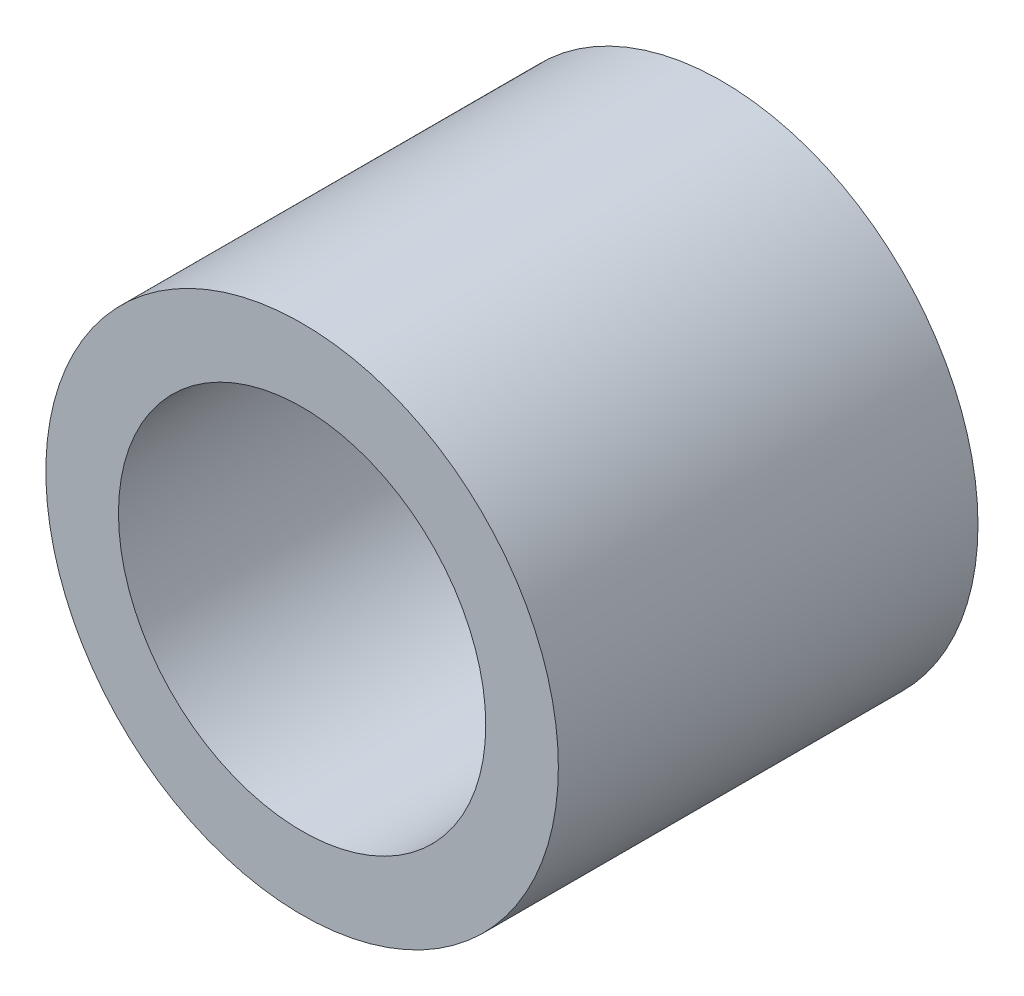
ISO-10303-21;
HEADER;
FILE_DESCRIPTION(('STEP AP214'),'2;1');
FILE_NAME('part.step','',(''),(''),'','','');
FILE_SCHEMA(('AUTOMOTIVE_DESIGN { 1 0 10303 214 1 1 1 1 }'));
ENDSEC;
DATA;
#1=APPLICATION_CONTEXT('core data for automotive mechanical design processes');
#2=APPLICATION_PROTOCOL_DEFINITION('international standard','automotive_design',2000,#1);
#3=PRODUCT_CONTEXT('',#1,'mechanical');
#4=PRODUCT('Part','Part','',(#3));
#5=PRODUCT_RELATED_PRODUCT_CATEGORY('part','',(#4));
#6=PRODUCT_DEFINITION_FORMATION('','',#4);
#7=PRODUCT_DEFINITION_CONTEXT('part definition',#1,'design');
#8=PRODUCT_DEFINITION('design','',#6,#7);
#9=PRODUCT_DEFINITION_SHAPE('','',#8);
#10=(LENGTH_UNIT() NAMED_UNIT(*) SI_UNIT(.MILLI.,.METRE.));
#11=(NAMED_UNIT(*) PLANE_ANGLE_UNIT() SI_UNIT($,.RADIAN.));
#12=(NAMED_UNIT(*) SI_UNIT($,.STERADIAN.) SOLID_ANGLE_UNIT());
#13=UNCERTAINTY_MEASURE_WITH_UNIT(LENGTH_MEASURE(1.E-05),#10,'distance_accuracy_value','');
#14=(GEOMETRIC_REPRESENTATION_CONTEXT(3) GLOBAL_UNCERTAINTY_ASSIGNED_CONTEXT((#13)) GLOBAL_UNIT_ASSIGNED_CONTEXT((#10,
#11,#12)) REPRESENTATION_CONTEXT('',''));
#15=CARTESIAN_POINT('',(0.,0.,0.));
#16=DIRECTION('',(0.,0.,1.));
#17=DIRECTION('',(1.,0.,0.));
#18=AXIS2_PLACEMENT_3D('',#15,#16,#17);
#19=CARTESIAN_POINT('',(0.,0.,19.65));
#20=DIRECTION('',(0.,0.,1.));
#21=DIRECTION('',(1.,0.,0.));
#22=AXIS2_PLACEMENT_3D('',#19,#20,#21);
#23=PLANE('',#22);
#24=CARTESIAN_POINT('',(0.,0.,19.65));
#25=DIRECTION('',(0.,0.,1.));
#26=DIRECTION('',(1.,0.,0.));
#27=AXIS2_PLACEMENT_3D('',#24,#25,#26);
#28=CIRCLE('',#27,12.);
#29=CARTESIAN_POINT('',(12.,0.,19.65));
#30=VERTEX_POINT('',#29);
#31=EDGE_CURVE('E10',#30,#30,#28,.T.);
#32=ORIENTED_EDGE('',*,*,#31,.T.);
#33=EDGE_LOOP('',(#32));
#34=FACE_BOUND('',#33,.T.);
#35=CARTESIAN_POINT('',(0.,0.,19.65));
#36=DIRECTION('',(0.,0.,1.));
#37=DIRECTION('',(1.,0.,0.));
#38=AXIS2_PLACEMENT_3D('',#35,#36,#37);
#39=CIRCLE('',#38,8.6);
#40=CARTESIAN_POINT('',(8.6,0.,19.65));
#41=VERTEX_POINT('',#40);
#42=EDGE_CURVE('E45',#41,#41,#39,.T.);
#43=ORIENTED_EDGE('',*,*,#42,.F.);
#44=EDGE_LOOP('',(#43));
#45=FACE_BOUND('',#44,.T.);
#46=ADVANCED_FACE('F34',(#34,#45),#23,.T.);
#47=CARTESIAN_POINT('',(0.,0.,0.));
#48=DIRECTION('',(0.,0.,1.));
#49=DIRECTION('',(1.,0.,0.));
#50=AXIS2_PLACEMENT_3D('',#47,#48,#49);
#51=PLANE('',#50);
#52=CARTESIAN_POINT('',(0.,0.,0.));
#53=DIRECTION('',(0.,0.,1.));
#54=DIRECTION('',(1.,0.,0.));
#55=AXIS2_PLACEMENT_3D('',#52,#53,#54);
#56=CIRCLE('',#55,12.);
#57=CARTESIAN_POINT('',(12.,0.,0.));
#58=VERTEX_POINT('',#57);
#59=EDGE_CURVE('E41',#58,#58,#56,.T.);
#60=ORIENTED_EDGE('',*,*,#59,.F.);
#61=EDGE_LOOP('',(#60));
#62=FACE_BOUND('',#61,.T.);
#63=CARTESIAN_POINT('',(0.,0.,0.));
#64=DIRECTION('',(0.,0.,1.));
#65=DIRECTION('',(1.,0.,0.));
#66=AXIS2_PLACEMENT_3D('',#63,#64,#65);
#67=CIRCLE('',#66,8.6);
#68=CARTESIAN_POINT('',(8.6,0.,0.));
#69=VERTEX_POINT('',#68);
#70=EDGE_CURVE('E49',#69,#69,#67,.T.);
#71=ORIENTED_EDGE('',*,*,#70,.T.);
#72=EDGE_LOOP('',(#71));
#73=FACE_BOUND('',#72,.T.);
#74=ADVANCED_FACE('F55',(#62,#73),#51,.F.);
#75=CARTESIAN_POINT('',(0.,0.,19.65));
#76=DIRECTION('',(0.,0.,-1.));
#77=DIRECTION('',(-1.,0.,0.));
#78=AXIS2_PLACEMENT_3D('',#75,#76,#77);
#79=CYLINDRICAL_SURFACE('',#78,12.);
#80=ORIENTED_EDGE('',*,*,#31,.F.);
#81=EDGE_LOOP('',(#80));
#82=FACE_BOUND('',#81,.T.);
#83=ORIENTED_EDGE('',*,*,#59,.T.);
#84=EDGE_LOOP('',(#83));
#85=FACE_BOUND('',#84,.T.);
#86=ADVANCED_FACE('F36',(#82,#85),#79,.T.);
#87=CARTESIAN_POINT('',(0.,0.,19.65));
#88=DIRECTION('',(0.,0.,-1.));
#89=DIRECTION('',(-1.,0.,0.));
#90=AXIS2_PLACEMENT_3D('',#87,#88,#89);
#91=CYLINDRICAL_SURFACE('',#90,8.6);
#92=ORIENTED_EDGE('',*,*,#42,.T.);
#93=EDGE_LOOP('',(#92));
#94=FACE_BOUND('',#93,.T.);
#95=ORIENTED_EDGE('',*,*,#70,.F.);
#96=EDGE_LOOP('',(#95));
#97=FACE_BOUND('',#96,.T.);
#98=ADVANCED_FACE('F57',(#94,#97),#91,.F.);
#99=CLOSED_SHELL('',(#46,#74,#86,#98));
#100=MANIFOLD_SOLID_BREP('B2',#99);
#101=ADVANCED_BREP_SHAPE_REPRESENTATION('',(#18,#100),#14);
#102=SHAPE_DEFINITION_REPRESENTATION(#9,#101);
ENDSEC;
END-ISO-10303-21;
